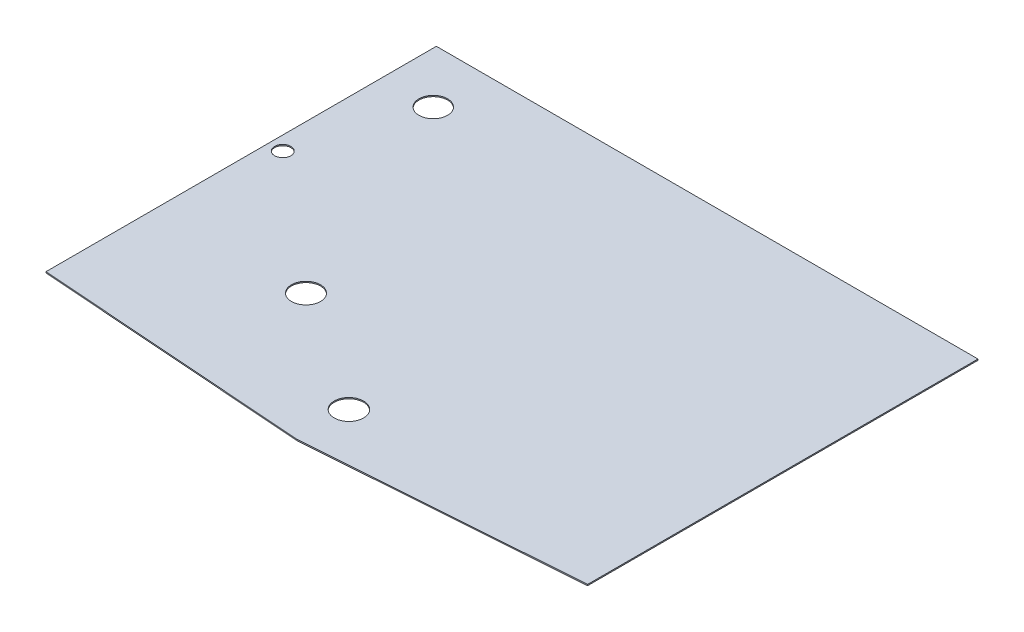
ISO-10303-21;
HEADER;
FILE_DESCRIPTION(('STEP AP214'),'2;1');
FILE_NAME('part.step','',(''),(''),'','','');
FILE_SCHEMA(('AUTOMOTIVE_DESIGN { 1 0 10303 214 1 1 1 1 }'));
ENDSEC;
DATA;
#1=APPLICATION_CONTEXT('core data for automotive mechanical design processes');
#2=APPLICATION_PROTOCOL_DEFINITION('international standard','automotive_design',2000,#1);
#3=PRODUCT_CONTEXT('',#1,'mechanical');
#4=PRODUCT('Part','Part','',(#3));
#5=PRODUCT_RELATED_PRODUCT_CATEGORY('part','',(#4));
#6=PRODUCT_DEFINITION_FORMATION('','',#4);
#7=PRODUCT_DEFINITION_CONTEXT('part definition',#1,'design');
#8=PRODUCT_DEFINITION('design','',#6,#7);
#9=PRODUCT_DEFINITION_SHAPE('','',#8);
#10=(LENGTH_UNIT() NAMED_UNIT(*) SI_UNIT(.MILLI.,.METRE.));
#11=(NAMED_UNIT(*) PLANE_ANGLE_UNIT() SI_UNIT($,.RADIAN.));
#12=(NAMED_UNIT(*) SI_UNIT($,.STERADIAN.) SOLID_ANGLE_UNIT());
#13=UNCERTAINTY_MEASURE_WITH_UNIT(LENGTH_MEASURE(1.E-05),#10,'distance_accuracy_value','');
#14=(GEOMETRIC_REPRESENTATION_CONTEXT(3) GLOBAL_UNCERTAINTY_ASSIGNED_CONTEXT((#13)) GLOBAL_UNIT_ASSIGNED_CONTEXT((#10,
#11,#12)) REPRESENTATION_CONTEXT('',''));
#15=CARTESIAN_POINT('',(0.,0.,0.));
#16=DIRECTION('',(0.,0.,1.));
#17=DIRECTION('',(1.,0.,0.));
#18=AXIS2_PLACEMENT_3D('',#15,#16,#17);
#19=CARTESIAN_POINT('',(-1111.25,-4.7625,0.));
#20=DIRECTION('',(-1.,0.,0.));
#21=DIRECTION('',(0.,0.,1.));
#22=AXIS2_PLACEMENT_3D('',#19,#20,#21);
#23=PLANE('',#22);
#24=DIRECTION('',(0.,0.,1.));
#25=VECTOR('',#24,1.);
#26=CARTESIAN_POINT('',(-1111.25,0.,0.));
#27=LINE('',#26,#25);
#28=CARTESIAN_POINT('',(-1111.25,0.,0.));
#29=VERTEX_POINT('',#28);
#30=CARTESIAN_POINT('',(-1111.25,0.,1601.7875));
#31=VERTEX_POINT('',#30);
#32=EDGE_CURVE('E116',#29,#31,#27,.T.);
#33=ORIENTED_EDGE('',*,*,#32,.F.);
#34=DIRECTION('',(0.,1.,0.));
#35=VECTOR('',#34,1.);
#36=CARTESIAN_POINT('',(-1111.25,-4.7625,0.));
#37=LINE('',#36,#35);
#38=CARTESIAN_POINT('',(-1111.25,-4.7625,0.));
#39=VERTEX_POINT('',#38);
#40=EDGE_CURVE('E11',#39,#29,#37,.T.);
#41=ORIENTED_EDGE('',*,*,#40,.F.);
#42=DIRECTION('',(0.,0.,1.));
#43=VECTOR('',#42,1.);
#44=CARTESIAN_POINT('',(-1111.25,-4.7625,0.));
#45=LINE('',#44,#43);
#46=CARTESIAN_POINT('',(-1111.25,-4.7625,1601.7875));
#47=VERTEX_POINT('',#46);
#48=EDGE_CURVE('E111',#39,#47,#45,.T.);
#49=ORIENTED_EDGE('',*,*,#48,.T.);
#50=DIRECTION('',(0.,1.,0.));
#51=VECTOR('',#50,1.);
#52=CARTESIAN_POINT('',(-1111.25,-4.7625,1601.7875));
#53=LINE('',#52,#51);
#54=EDGE_CURVE('E42',#47,#31,#53,.T.);
#55=ORIENTED_EDGE('',*,*,#54,.T.);
#56=EDGE_LOOP('',(#33,#41,#49,#55));
#57=FACE_BOUND('',#56,.T.);
#58=ADVANCED_FACE('F39',(#57),#23,.T.);
#59=CARTESIAN_POINT('',(-1111.25,-4.7625,0.));
#60=DIRECTION('',(0.,0.,-1.));
#61=DIRECTION('',(-1.,0.,0.));
#62=AXIS2_PLACEMENT_3D('',#59,#60,#61);
#63=PLANE('',#62);
#64=DIRECTION('',(-1.,0.,0.));
#65=VECTOR('',#64,1.);
#66=CARTESIAN_POINT('',(-1111.25,0.,0.));
#67=LINE('',#66,#65);
#68=CARTESIAN_POINT('',(1111.25,0.,-2.72177751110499E-13));
#69=VERTEX_POINT('',#68);
#70=EDGE_CURVE('E126',#69,#29,#67,.T.);
#71=ORIENTED_EDGE('',*,*,#70,.F.);
#72=DIRECTION('',(0.,1.,0.));
#73=VECTOR('',#72,1.);
#74=CARTESIAN_POINT('',(1111.25,-4.7625,-2.72177751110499E-13));
#75=LINE('',#74,#73);
#76=CARTESIAN_POINT('',(1111.25,-4.7625,-2.72177751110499E-13));
#77=VERTEX_POINT('',#76);
#78=EDGE_CURVE('E48',#77,#69,#75,.T.);
#79=ORIENTED_EDGE('',*,*,#78,.F.);
#80=DIRECTION('',(-1.,0.,0.));
#81=VECTOR('',#80,1.);
#82=CARTESIAN_POINT('',(-1111.25,-4.7625,0.));
#83=LINE('',#82,#81);
#84=EDGE_CURVE('E106',#77,#39,#83,.T.);
#85=ORIENTED_EDGE('',*,*,#84,.T.);
#86=ORIENTED_EDGE('',*,*,#40,.T.);
#87=EDGE_LOOP('',(#71,#79,#85,#86));
#88=FACE_BOUND('',#87,.T.);
#89=ADVANCED_FACE('F132',(#88),#63,.T.);
#90=CARTESIAN_POINT('',(1111.25,-4.7625,-2.72177751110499E-13));
#91=DIRECTION('',(1.,0.,0.));
#92=DIRECTION('',(0.,0.,-1.));
#93=AXIS2_PLACEMENT_3D('',#90,#91,#92);
#94=PLANE('',#93);
#95=DIRECTION('',(0.,0.,-1.));
#96=VECTOR('',#95,1.);
#97=CARTESIAN_POINT('',(1111.25,0.,-2.72177751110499E-13));
#98=LINE('',#97,#96);
#99=CARTESIAN_POINT('',(1111.25,0.,1601.7875));
#100=VERTEX_POINT('',#99);
#101=EDGE_CURVE('E95',#100,#69,#98,.T.);
#102=ORIENTED_EDGE('',*,*,#101,.F.);
#103=DIRECTION('',(0.,1.,0.));
#104=VECTOR('',#103,1.);
#105=CARTESIAN_POINT('',(1111.25,-4.7625,1601.7875));
#106=LINE('',#105,#104);
#107=CARTESIAN_POINT('',(1111.25,-4.7625,1601.7875));
#108=VERTEX_POINT('',#107);
#109=EDGE_CURVE('E90',#108,#100,#106,.T.);
#110=ORIENTED_EDGE('',*,*,#109,.F.);
#111=DIRECTION('',(0.,0.,-1.));
#112=VECTOR('',#111,1.);
#113=CARTESIAN_POINT('',(1111.25,-4.7625,-2.72177751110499E-13));
#114=LINE('',#113,#112);
#115=EDGE_CURVE('E93',#108,#77,#114,.T.);
#116=ORIENTED_EDGE('',*,*,#115,.T.);
#117=ORIENTED_EDGE('',*,*,#78,.T.);
#118=EDGE_LOOP('',(#102,#110,#116,#117));
#119=FACE_BOUND('',#118,.T.);
#120=ADVANCED_FACE('F92',(#119),#94,.T.);
#121=CARTESIAN_POINT('',(2.22044604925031E-13,-4.7625,1682.75));
#122=DIRECTION('',(0.0726645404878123,0.,0.997356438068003));
#123=DIRECTION('',(0.997356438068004,0.,-0.0726645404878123));
#124=AXIS2_PLACEMENT_3D('',#121,#122,#123);
#125=PLANE('',#124);
#126=DIRECTION('',(0.997356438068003,0.,-0.0726645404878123));
#127=VECTOR('',#126,1.);
#128=CARTESIAN_POINT('',(2.22044604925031E-13,0.,1682.75));
#129=LINE('',#128,#127);
#130=CARTESIAN_POINT('',(2.22044604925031E-13,0.,1682.75));
#131=VERTEX_POINT('',#130);
#132=EDGE_CURVE('E123',#131,#100,#129,.T.);
#133=ORIENTED_EDGE('',*,*,#132,.F.);
#134=DIRECTION('',(0.,1.,0.));
#135=VECTOR('',#134,1.);
#136=CARTESIAN_POINT('',(2.22044604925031E-13,-4.7625,1682.75));
#137=LINE('',#136,#135);
#138=CARTESIAN_POINT('',(2.22044604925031E-13,-4.7625,1682.75));
#139=VERTEX_POINT('',#138);
#140=EDGE_CURVE('E100',#139,#131,#137,.T.);
#141=ORIENTED_EDGE('',*,*,#140,.F.);
#142=DIRECTION('',(0.997356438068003,0.,-0.0726645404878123));
#143=VECTOR('',#142,1.);
#144=CARTESIAN_POINT('',(2.22044604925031E-13,-4.7625,1682.75));
#145=LINE('',#144,#143);
#146=EDGE_CURVE('E105',#139,#108,#145,.T.);
#147=ORIENTED_EDGE('',*,*,#146,.T.);
#148=ORIENTED_EDGE('',*,*,#109,.T.);
#149=EDGE_LOOP('',(#133,#141,#147,#148));
#150=FACE_BOUND('',#149,.T.);
#151=ADVANCED_FACE('F108',(#150),#125,.T.);
#152=CARTESIAN_POINT('',(-1111.25,-4.7625,1601.7875));
#153=DIRECTION('',(-0.0726645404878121,0.,0.997356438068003));
#154=DIRECTION('',(0.997356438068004,0.,0.0726645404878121));
#155=AXIS2_PLACEMENT_3D('',#152,#153,#154);
#156=PLANE('',#155);
#157=DIRECTION('',(0.997356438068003,0.,0.0726645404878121));
#158=VECTOR('',#157,1.);
#159=CARTESIAN_POINT('',(-1111.25,0.,1601.7875));
#160=LINE('',#159,#158);
#161=EDGE_CURVE('E119',#31,#131,#160,.T.);
#162=ORIENTED_EDGE('',*,*,#161,.F.);
#163=ORIENTED_EDGE('',*,*,#54,.F.);
#164=DIRECTION('',(0.997356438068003,0.,0.0726645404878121));
#165=VECTOR('',#164,1.);
#166=CARTESIAN_POINT('',(-1111.25,-4.7625,1601.7875));
#167=LINE('',#166,#165);
#168=EDGE_CURVE('E109',#47,#139,#167,.T.);
#169=ORIENTED_EDGE('',*,*,#168,.T.);
#170=ORIENTED_EDGE('',*,*,#140,.T.);
#171=EDGE_LOOP('',(#162,#163,#169,#170));
#172=FACE_BOUND('',#171,.T.);
#173=ADVANCED_FACE('F129',(#172),#156,.T.);
#174=CARTESIAN_POINT('',(-1111.25,-4.7625,0.));
#175=DIRECTION('',(0.,1.,0.));
#176=DIRECTION('',(0.,0.,1.));
#177=AXIS2_PLACEMENT_3D('',#174,#175,#176);
#178=PLANE('',#177);
#179=CARTESIAN_POINT('',(2.22044604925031E-13,-4.7625,1470.025));
#180=DIRECTION('',(0.,1.,0.));
#181=DIRECTION('',(0.,0.,1.));
#182=AXIS2_PLACEMENT_3D('',#179,#180,#181);
#183=CIRCLE('',#182,60.3250000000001);
#184=CARTESIAN_POINT('',(2.22044604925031E-13,-4.7625,1530.35));
#185=VERTEX_POINT('',#184);
#186=EDGE_CURVE('E175',#185,#185,#183,.T.);
#187=ORIENTED_EDGE('',*,*,#186,.T.);
#188=EDGE_LOOP('',(#187));
#189=FACE_BOUND('',#188,.T.);
#190=CARTESIAN_POINT('',(-1054.1,-4.7625,687.387499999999));
#191=DIRECTION('',(0.,1.,0.));
#192=DIRECTION('',(0.,0.,1.));
#193=AXIS2_PLACEMENT_3D('',#190,#191,#192);
#194=CIRCLE('',#193,33.3375);
#195=CARTESIAN_POINT('',(-1054.1,-4.7625,720.724999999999));
#196=VERTEX_POINT('',#195);
#197=EDGE_CURVE('E183',#196,#196,#194,.T.);
#198=ORIENTED_EDGE('',*,*,#197,.T.);
#199=EDGE_LOOP('',(#198));
#200=FACE_BOUND('',#199,.T.);
#201=CARTESIAN_POINT('',(-501.65,-4.7625,1144.5875));
#202=DIRECTION('',(0.,1.,0.));
#203=DIRECTION('',(0.,0.,1.));
#204=AXIS2_PLACEMENT_3D('',#201,#202,#203);
#205=CIRCLE('',#204,59.5312500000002);
#206=CARTESIAN_POINT('',(-501.65,-4.7625,1204.11875));
#207=VERTEX_POINT('',#206);
#208=EDGE_CURVE('E189',#207,#207,#205,.T.);
#209=ORIENTED_EDGE('',*,*,#208,.T.);
#210=EDGE_LOOP('',(#209));
#211=FACE_BOUND('',#210,.T.);
#212=CARTESIAN_POINT('',(-901.7,-4.7625,222.25));
#213=DIRECTION('',(0.,1.,0.));
#214=DIRECTION('',(0.,0.,1.));
#215=AXIS2_PLACEMENT_3D('',#212,#213,#214);
#216=CIRCLE('',#215,58.7374999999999);
#217=CARTESIAN_POINT('',(-901.7,-4.7625,280.9875));
#218=VERTEX_POINT('',#217);
#219=EDGE_CURVE('E120',#218,#218,#216,.T.);
#220=ORIENTED_EDGE('',*,*,#219,.T.);
#221=EDGE_LOOP('',(#220));
#222=FACE_BOUND('',#221,.T.);
#223=ORIENTED_EDGE('',*,*,#48,.F.);
#224=ORIENTED_EDGE('',*,*,#84,.F.);
#225=ORIENTED_EDGE('',*,*,#115,.F.);
#226=ORIENTED_EDGE('',*,*,#146,.F.);
#227=ORIENTED_EDGE('',*,*,#168,.F.);
#228=EDGE_LOOP('',(#223,#224,#225,#226,#227));
#229=FACE_BOUND('',#228,.T.);
#230=ADVANCED_FACE('F104',(#189,#200,#211,#222,#229),#178,.F.);
#231=CARTESIAN_POINT('',(-1111.25,0.,0.));
#232=DIRECTION('',(0.,1.,0.));
#233=DIRECTION('',(0.,0.,1.));
#234=AXIS2_PLACEMENT_3D('',#231,#232,#233);
#235=PLANE('',#234);
#236=CARTESIAN_POINT('',(2.22044604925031E-13,0.,1470.025));
#237=DIRECTION('',(0.,1.,0.));
#238=DIRECTION('',(0.,0.,1.));
#239=AXIS2_PLACEMENT_3D('',#236,#237,#238);
#240=CIRCLE('',#239,60.3250000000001);
#241=CARTESIAN_POINT('',(2.22044604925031E-13,0.,1530.35));
#242=VERTEX_POINT('',#241);
#243=EDGE_CURVE('E178',#242,#242,#240,.T.);
#244=ORIENTED_EDGE('',*,*,#243,.F.);
#245=EDGE_LOOP('',(#244));
#246=FACE_BOUND('',#245,.T.);
#247=CARTESIAN_POINT('',(-1054.1,0.,687.387499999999));
#248=DIRECTION('',(0.,1.,0.));
#249=DIRECTION('',(0.,0.,1.));
#250=AXIS2_PLACEMENT_3D('',#247,#248,#249);
#251=CIRCLE('',#250,33.3375);
#252=CARTESIAN_POINT('',(-1054.1,0.,720.724999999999));
#253=VERTEX_POINT('',#252);
#254=EDGE_CURVE('E180',#253,#253,#251,.T.);
#255=ORIENTED_EDGE('',*,*,#254,.F.);
#256=EDGE_LOOP('',(#255));
#257=FACE_BOUND('',#256,.T.);
#258=CARTESIAN_POINT('',(-501.65,0.,1144.5875));
#259=DIRECTION('',(0.,1.,0.));
#260=DIRECTION('',(0.,0.,1.));
#261=AXIS2_PLACEMENT_3D('',#258,#259,#260);
#262=CIRCLE('',#261,59.5312500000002);
#263=CARTESIAN_POINT('',(-501.65,0.,1204.11875));
#264=VERTEX_POINT('',#263);
#265=EDGE_CURVE('E186',#264,#264,#262,.T.);
#266=ORIENTED_EDGE('',*,*,#265,.F.);
#267=EDGE_LOOP('',(#266));
#268=FACE_BOUND('',#267,.T.);
#269=CARTESIAN_POINT('',(-901.7,0.,222.25));
#270=DIRECTION('',(0.,1.,0.));
#271=DIRECTION('',(0.,0.,1.));
#272=AXIS2_PLACEMENT_3D('',#269,#270,#271);
#273=CIRCLE('',#272,58.7374999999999);
#274=CARTESIAN_POINT('',(-901.7,0.,280.9875));
#275=VERTEX_POINT('',#274);
#276=EDGE_CURVE('E192',#275,#275,#273,.T.);
#277=ORIENTED_EDGE('',*,*,#276,.F.);
#278=EDGE_LOOP('',(#277));
#279=FACE_BOUND('',#278,.T.);
#280=ORIENTED_EDGE('',*,*,#32,.T.);
#281=ORIENTED_EDGE('',*,*,#161,.T.);
#282=ORIENTED_EDGE('',*,*,#132,.T.);
#283=ORIENTED_EDGE('',*,*,#101,.T.);
#284=ORIENTED_EDGE('',*,*,#70,.T.);
#285=EDGE_LOOP('',(#280,#281,#282,#283,#284));
#286=FACE_BOUND('',#285,.T.);
#287=ADVANCED_FACE('F131',(#246,#257,#268,#279,#286),#235,.T.);
#288=CARTESIAN_POINT('',(-901.7,-4.7625,222.25));
#289=DIRECTION('',(0.,1.,0.));
#290=DIRECTION('',(0.,0.,1.));
#291=AXIS2_PLACEMENT_3D('',#288,#289,#290);
#292=CYLINDRICAL_SURFACE('',#291,58.7374999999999);
#293=CARTESIAN_POINT('',(-901.7,-4.7625,280.9875));
#294=CARTESIAN_POINT('',(-901.7,-4.712890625,280.9875));
#295=CARTESIAN_POINT('',(-901.7,-4.66328125,280.9875));
#296=CARTESIAN_POINT('',(-901.7,-4.5640625,280.9875));
#297=CARTESIAN_POINT('',(-901.7,-4.514453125,280.9875));
#298=CARTESIAN_POINT('',(-901.7,-4.415234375,280.9875));
#299=CARTESIAN_POINT('',(-901.7,-4.365625,280.9875));
#300=CARTESIAN_POINT('',(-901.7,-4.26640625,280.9875));
#301=CARTESIAN_POINT('',(-901.7,-4.216796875,280.9875));
#302=CARTESIAN_POINT('',(-901.7,-4.117578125,280.9875));
#303=CARTESIAN_POINT('',(-901.7,-4.06796875,280.9875));
#304=CARTESIAN_POINT('',(-901.7,-3.96875,280.9875));
#305=CARTESIAN_POINT('',(-901.7,-3.919140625,280.9875));
#306=CARTESIAN_POINT('',(-901.7,-3.819921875,280.9875));
#307=CARTESIAN_POINT('',(-901.7,-3.7703125,280.9875));
#308=CARTESIAN_POINT('',(-901.7,-3.67109375,280.9875));
#309=CARTESIAN_POINT('',(-901.7,-3.621484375,280.9875));
#310=CARTESIAN_POINT('',(-901.7,-3.522265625,280.9875));
#311=CARTESIAN_POINT('',(-901.7,-3.47265625,280.9875));
#312=CARTESIAN_POINT('',(-901.7,-3.3734375,280.9875));
#313=CARTESIAN_POINT('',(-901.7,-3.323828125,280.9875));
#314=CARTESIAN_POINT('',(-901.7,-3.224609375,280.9875));
#315=CARTESIAN_POINT('',(-901.7,-3.175,280.9875));
#316=CARTESIAN_POINT('',(-901.7,-3.07578125,280.9875));
#317=CARTESIAN_POINT('',(-901.7,-3.026171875,280.9875));
#318=CARTESIAN_POINT('',(-901.7,-2.926953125,280.9875));
#319=CARTESIAN_POINT('',(-901.7,-2.87734375,280.9875));
#320=CARTESIAN_POINT('',(-901.7,-2.778125,280.9875));
#321=CARTESIAN_POINT('',(-901.7,-2.728515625,280.9875));
#322=CARTESIAN_POINT('',(-901.7,-2.629296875,280.9875));
#323=CARTESIAN_POINT('',(-901.7,-2.5796875,280.9875));
#324=CARTESIAN_POINT('',(-901.7,-2.48046875,280.9875));
#325=CARTESIAN_POINT('',(-901.7,-2.430859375,280.9875));
#326=CARTESIAN_POINT('',(-901.7,-2.331640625,280.9875));
#327=CARTESIAN_POINT('',(-901.7,-2.28203125,280.9875));
#328=CARTESIAN_POINT('',(-901.7,-2.1828125,280.9875));
#329=CARTESIAN_POINT('',(-901.7,-2.133203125,280.9875));
#330=CARTESIAN_POINT('',(-901.7,-2.033984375,280.9875));
#331=CARTESIAN_POINT('',(-901.7,-1.984375,280.9875));
#332=CARTESIAN_POINT('',(-901.7,-1.88515625,280.9875));
#333=CARTESIAN_POINT('',(-901.7,-1.835546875,280.9875));
#334=CARTESIAN_POINT('',(-901.7,-1.736328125,280.9875));
#335=CARTESIAN_POINT('',(-901.7,-1.68671875,280.9875));
#336=CARTESIAN_POINT('',(-901.7,-1.5875,280.9875));
#337=CARTESIAN_POINT('',(-901.7,-1.537890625,280.9875));
#338=CARTESIAN_POINT('',(-901.7,-1.438671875,280.9875));
#339=CARTESIAN_POINT('',(-901.7,-1.3890625,280.9875));
#340=CARTESIAN_POINT('',(-901.7,-1.28984375,280.9875));
#341=CARTESIAN_POINT('',(-901.7,-1.240234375,280.9875));
#342=CARTESIAN_POINT('',(-901.7,-1.141015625,280.9875));
#343=CARTESIAN_POINT('',(-901.7,-1.09140625,280.9875));
#344=CARTESIAN_POINT('',(-901.7,-0.9921875,280.9875));
#345=CARTESIAN_POINT('',(-901.7,-0.942578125,280.9875));
#346=CARTESIAN_POINT('',(-901.7,-0.843359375,280.9875));
#347=CARTESIAN_POINT('',(-901.7,-0.79375,280.9875));
#348=CARTESIAN_POINT('',(-901.7,-0.69453125,280.9875));
#349=CARTESIAN_POINT('',(-901.7,-0.644921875,280.9875));
#350=CARTESIAN_POINT('',(-901.7,-0.545703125,280.9875));
#351=CARTESIAN_POINT('',(-901.7,-0.49609375,280.9875));
#352=CARTESIAN_POINT('',(-901.7,-0.396875,280.9875));
#353=CARTESIAN_POINT('',(-901.7,-0.347265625,280.9875));
#354=CARTESIAN_POINT('',(-901.7,-0.248046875,280.9875));
#355=CARTESIAN_POINT('',(-901.7,-0.1984375,280.9875));
#356=CARTESIAN_POINT('',(-901.7,-0.09921875,280.9875));
#357=CARTESIAN_POINT('',(-901.7,-0.049609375,280.9875));
#358=CARTESIAN_POINT('',(-901.7,0.,280.9875));
#359=B_SPLINE_CURVE_WITH_KNOTS('',3,(#293,#294,#295,#296,#297,#298,#299,#300,#301,#302,#303,
#304,#305,#306,#307,#308,#309,#310,#311,#312,#313,#314,#315,#316,#317,#318,#319,#320,#321,#322,
#323,#324,#325,#326,#327,#328,#329,#330,#331,#332,#333,#334,#335,#336,#337,#338,#339,#340,#341,
#342,#343,#344,#345,#346,#347,#348,#349,#350,#351,#352,#353,#354,#355,#356,#357,#358),
.UNSPECIFIED.,.F.,.F.,(4,2,2,2,2,2,2,2,2,2,2,2,2,2,2,2,2,2,2,2,2,2,2,2,2,2,2,2,2,2,2,2,4),(0.,
0.148828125,0.29765625,0.446484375,0.5953125,0.744140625,0.892968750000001,1.041796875,1.190625,
1.339453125,1.48828125,1.637109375,1.7859375,1.934765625,2.08359375,2.232421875,2.38125,
2.530078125,2.67890625,2.827734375,2.9765625,3.125390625,3.27421875,3.423046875,3.571875,
3.720703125,3.86953125,4.018359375,4.1671875,4.316015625,4.46484375,4.613671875,4.7625),.UNSPECIFIED.);
#360=EDGE_CURVE('BSEAM152',#218,#275,#359,.T.);
#361=ORIENTED_EDGE('',*,*,#219,.F.);
#362=ORIENTED_EDGE('',*,*,#276,.T.);
#363=ORIENTED_EDGE('',*,*,#360,.T.);
#364=ORIENTED_EDGE('',*,*,#360,.F.);
#365=EDGE_LOOP('',(#361,#363,#362,#364));
#366=FACE_BOUND('',#365,.T.);
#367=ADVANCED_FACE('F152',(#366),#292,.F.);
#368=CARTESIAN_POINT('',(-501.65,-4.7625,1144.5875));
#369=DIRECTION('',(0.,1.,0.));
#370=DIRECTION('',(0.,0.,1.));
#371=AXIS2_PLACEMENT_3D('',#368,#369,#370);
#372=CYLINDRICAL_SURFACE('',#371,59.5312500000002);
#373=CARTESIAN_POINT('',(-501.65,-4.7625,1204.11875));
#374=CARTESIAN_POINT('',(-501.65,-4.712890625,1204.11875));
#375=CARTESIAN_POINT('',(-501.65,-4.66328125,1204.11875));
#376=CARTESIAN_POINT('',(-501.65,-4.5640625,1204.11875));
#377=CARTESIAN_POINT('',(-501.65,-4.514453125,1204.11875));
#378=CARTESIAN_POINT('',(-501.65,-4.415234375,1204.11875));
#379=CARTESIAN_POINT('',(-501.65,-4.365625,1204.11875));
#380=CARTESIAN_POINT('',(-501.65,-4.26640625,1204.11875));
#381=CARTESIAN_POINT('',(-501.65,-4.216796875,1204.11875));
#382=CARTESIAN_POINT('',(-501.65,-4.117578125,1204.11875));
#383=CARTESIAN_POINT('',(-501.65,-4.06796875,1204.11875));
#384=CARTESIAN_POINT('',(-501.65,-3.96875,1204.11875));
#385=CARTESIAN_POINT('',(-501.65,-3.919140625,1204.11875));
#386=CARTESIAN_POINT('',(-501.65,-3.819921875,1204.11875));
#387=CARTESIAN_POINT('',(-501.65,-3.7703125,1204.11875));
#388=CARTESIAN_POINT('',(-501.65,-3.67109375,1204.11875));
#389=CARTESIAN_POINT('',(-501.65,-3.621484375,1204.11875));
#390=CARTESIAN_POINT('',(-501.65,-3.522265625,1204.11875));
#391=CARTESIAN_POINT('',(-501.65,-3.47265625,1204.11875));
#392=CARTESIAN_POINT('',(-501.65,-3.3734375,1204.11875));
#393=CARTESIAN_POINT('',(-501.65,-3.323828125,1204.11875));
#394=CARTESIAN_POINT('',(-501.65,-3.224609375,1204.11875));
#395=CARTESIAN_POINT('',(-501.65,-3.175,1204.11875));
#396=CARTESIAN_POINT('',(-501.65,-3.07578125,1204.11875));
#397=CARTESIAN_POINT('',(-501.65,-3.026171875,1204.11875));
#398=CARTESIAN_POINT('',(-501.65,-2.926953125,1204.11875));
#399=CARTESIAN_POINT('',(-501.65,-2.87734375,1204.11875));
#400=CARTESIAN_POINT('',(-501.65,-2.778125,1204.11875));
#401=CARTESIAN_POINT('',(-501.65,-2.728515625,1204.11875));
#402=CARTESIAN_POINT('',(-501.65,-2.629296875,1204.11875));
#403=CARTESIAN_POINT('',(-501.65,-2.5796875,1204.11875));
#404=CARTESIAN_POINT('',(-501.65,-2.48046875,1204.11875));
#405=CARTESIAN_POINT('',(-501.65,-2.430859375,1204.11875));
#406=CARTESIAN_POINT('',(-501.65,-2.331640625,1204.11875));
#407=CARTESIAN_POINT('',(-501.65,-2.28203125,1204.11875));
#408=CARTESIAN_POINT('',(-501.65,-2.1828125,1204.11875));
#409=CARTESIAN_POINT('',(-501.65,-2.133203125,1204.11875));
#410=CARTESIAN_POINT('',(-501.65,-2.033984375,1204.11875));
#411=CARTESIAN_POINT('',(-501.65,-1.984375,1204.11875));
#412=CARTESIAN_POINT('',(-501.65,-1.88515625,1204.11875));
#413=CARTESIAN_POINT('',(-501.65,-1.835546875,1204.11875));
#414=CARTESIAN_POINT('',(-501.65,-1.736328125,1204.11875));
#415=CARTESIAN_POINT('',(-501.65,-1.68671875,1204.11875));
#416=CARTESIAN_POINT('',(-501.65,-1.5875,1204.11875));
#417=CARTESIAN_POINT('',(-501.65,-1.537890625,1204.11875));
#418=CARTESIAN_POINT('',(-501.65,-1.438671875,1204.11875));
#419=CARTESIAN_POINT('',(-501.65,-1.3890625,1204.11875));
#420=CARTESIAN_POINT('',(-501.65,-1.28984375,1204.11875));
#421=CARTESIAN_POINT('',(-501.65,-1.240234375,1204.11875));
#422=CARTESIAN_POINT('',(-501.65,-1.141015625,1204.11875));
#423=CARTESIAN_POINT('',(-501.65,-1.09140625,1204.11875));
#424=CARTESIAN_POINT('',(-501.65,-0.9921875,1204.11875));
#425=CARTESIAN_POINT('',(-501.65,-0.942578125,1204.11875));
#426=CARTESIAN_POINT('',(-501.65,-0.843359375,1204.11875));
#427=CARTESIAN_POINT('',(-501.65,-0.79375,1204.11875));
#428=CARTESIAN_POINT('',(-501.65,-0.69453125,1204.11875));
#429=CARTESIAN_POINT('',(-501.65,-0.644921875,1204.11875));
#430=CARTESIAN_POINT('',(-501.65,-0.545703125,1204.11875));
#431=CARTESIAN_POINT('',(-501.65,-0.49609375,1204.11875));
#432=CARTESIAN_POINT('',(-501.65,-0.396875,1204.11875));
#433=CARTESIAN_POINT('',(-501.65,-0.347265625,1204.11875));
#434=CARTESIAN_POINT('',(-501.65,-0.248046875,1204.11875));
#435=CARTESIAN_POINT('',(-501.65,-0.1984375,1204.11875));
#436=CARTESIAN_POINT('',(-501.65,-0.09921875,1204.11875));
#437=CARTESIAN_POINT('',(-501.65,-0.049609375,1204.11875));
#438=CARTESIAN_POINT('',(-501.65,0.,1204.11875));
#439=B_SPLINE_CURVE_WITH_KNOTS('',3,(#373,#374,#375,#376,#377,#378,#379,#380,#381,#382,#383,
#384,#385,#386,#387,#388,#389,#390,#391,#392,#393,#394,#395,#396,#397,#398,#399,#400,#401,#402,
#403,#404,#405,#406,#407,#408,#409,#410,#411,#412,#413,#414,#415,#416,#417,#418,#419,#420,#421,
#422,#423,#424,#425,#426,#427,#428,#429,#430,#431,#432,#433,#434,#435,#436,#437,#438),
.UNSPECIFIED.,.F.,.F.,(4,2,2,2,2,2,2,2,2,2,2,2,2,2,2,2,2,2,2,2,2,2,2,2,2,2,2,2,2,2,2,2,4),(0.,
0.148828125,0.29765625,0.446484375,0.5953125,0.744140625,0.892968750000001,1.041796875,1.190625,
1.339453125,1.48828125,1.637109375,1.7859375,1.934765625,2.08359375,2.232421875,2.38125,
2.530078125,2.67890625,2.827734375,2.9765625,3.125390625,3.27421875,3.423046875,3.571875,
3.720703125,3.86953125,4.018359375,4.1671875,4.316015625,4.46484375,4.613671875,4.7625),.UNSPECIFIED.);
#440=EDGE_CURVE('BSEAM159',#207,#264,#439,.T.);
#441=ORIENTED_EDGE('',*,*,#208,.F.);
#442=ORIENTED_EDGE('',*,*,#265,.T.);
#443=ORIENTED_EDGE('',*,*,#440,.T.);
#444=ORIENTED_EDGE('',*,*,#440,.F.);
#445=EDGE_LOOP('',(#441,#443,#442,#444));
#446=FACE_BOUND('',#445,.T.);
#447=ADVANCED_FACE('F159',(#446),#372,.F.);
#448=CARTESIAN_POINT('',(-1054.1,-4.7625,687.387499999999));
#449=DIRECTION('',(0.,1.,0.));
#450=DIRECTION('',(0.,0.,1.));
#451=AXIS2_PLACEMENT_3D('',#448,#449,#450);
#452=CYLINDRICAL_SURFACE('',#451,33.3375);
#453=CARTESIAN_POINT('',(-1054.1,-4.7625,720.724999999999));
#454=CARTESIAN_POINT('',(-1054.1,-4.712890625,720.724999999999));
#455=CARTESIAN_POINT('',(-1054.1,-4.66328125,720.724999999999));
#456=CARTESIAN_POINT('',(-1054.1,-4.5640625,720.724999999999));
#457=CARTESIAN_POINT('',(-1054.1,-4.514453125,720.724999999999));
#458=CARTESIAN_POINT('',(-1054.1,-4.415234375,720.724999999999));
#459=CARTESIAN_POINT('',(-1054.1,-4.365625,720.724999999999));
#460=CARTESIAN_POINT('',(-1054.1,-4.26640625,720.724999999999));
#461=CARTESIAN_POINT('',(-1054.1,-4.216796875,720.724999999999));
#462=CARTESIAN_POINT('',(-1054.1,-4.117578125,720.724999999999));
#463=CARTESIAN_POINT('',(-1054.1,-4.06796875,720.724999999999));
#464=CARTESIAN_POINT('',(-1054.1,-3.96875,720.724999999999));
#465=CARTESIAN_POINT('',(-1054.1,-3.919140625,720.724999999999));
#466=CARTESIAN_POINT('',(-1054.1,-3.819921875,720.724999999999));
#467=CARTESIAN_POINT('',(-1054.1,-3.7703125,720.724999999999));
#468=CARTESIAN_POINT('',(-1054.1,-3.67109375,720.724999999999));
#469=CARTESIAN_POINT('',(-1054.1,-3.621484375,720.724999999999));
#470=CARTESIAN_POINT('',(-1054.1,-3.522265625,720.724999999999));
#471=CARTESIAN_POINT('',(-1054.1,-3.47265625,720.724999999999));
#472=CARTESIAN_POINT('',(-1054.1,-3.3734375,720.724999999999));
#473=CARTESIAN_POINT('',(-1054.1,-3.323828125,720.724999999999));
#474=CARTESIAN_POINT('',(-1054.1,-3.224609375,720.724999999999));
#475=CARTESIAN_POINT('',(-1054.1,-3.175,720.724999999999));
#476=CARTESIAN_POINT('',(-1054.1,-3.07578125,720.724999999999));
#477=CARTESIAN_POINT('',(-1054.1,-3.026171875,720.724999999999));
#478=CARTESIAN_POINT('',(-1054.1,-2.926953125,720.724999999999));
#479=CARTESIAN_POINT('',(-1054.1,-2.87734375,720.724999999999));
#480=CARTESIAN_POINT('',(-1054.1,-2.778125,720.724999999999));
#481=CARTESIAN_POINT('',(-1054.1,-2.728515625,720.724999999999));
#482=CARTESIAN_POINT('',(-1054.1,-2.629296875,720.724999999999));
#483=CARTESIAN_POINT('',(-1054.1,-2.5796875,720.724999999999));
#484=CARTESIAN_POINT('',(-1054.1,-2.48046875,720.724999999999));
#485=CARTESIAN_POINT('',(-1054.1,-2.430859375,720.724999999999));
#486=CARTESIAN_POINT('',(-1054.1,-2.331640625,720.724999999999));
#487=CARTESIAN_POINT('',(-1054.1,-2.28203125,720.724999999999));
#488=CARTESIAN_POINT('',(-1054.1,-2.1828125,720.724999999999));
#489=CARTESIAN_POINT('',(-1054.1,-2.133203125,720.724999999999));
#490=CARTESIAN_POINT('',(-1054.1,-2.033984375,720.724999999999));
#491=CARTESIAN_POINT('',(-1054.1,-1.984375,720.724999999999));
#492=CARTESIAN_POINT('',(-1054.1,-1.88515625,720.724999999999));
#493=CARTESIAN_POINT('',(-1054.1,-1.835546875,720.724999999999));
#494=CARTESIAN_POINT('',(-1054.1,-1.736328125,720.724999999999));
#495=CARTESIAN_POINT('',(-1054.1,-1.68671875,720.724999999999));
#496=CARTESIAN_POINT('',(-1054.1,-1.5875,720.724999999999));
#497=CARTESIAN_POINT('',(-1054.1,-1.537890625,720.724999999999));
#498=CARTESIAN_POINT('',(-1054.1,-1.438671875,720.724999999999));
#499=CARTESIAN_POINT('',(-1054.1,-1.3890625,720.724999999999));
#500=CARTESIAN_POINT('',(-1054.1,-1.28984375,720.724999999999));
#501=CARTESIAN_POINT('',(-1054.1,-1.240234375,720.724999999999));
#502=CARTESIAN_POINT('',(-1054.1,-1.141015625,720.724999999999));
#503=CARTESIAN_POINT('',(-1054.1,-1.09140625,720.724999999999));
#504=CARTESIAN_POINT('',(-1054.1,-0.9921875,720.724999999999));
#505=CARTESIAN_POINT('',(-1054.1,-0.942578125,720.724999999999));
#506=CARTESIAN_POINT('',(-1054.1,-0.843359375,720.724999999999));
#507=CARTESIAN_POINT('',(-1054.1,-0.79375,720.724999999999));
#508=CARTESIAN_POINT('',(-1054.1,-0.69453125,720.724999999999));
#509=CARTESIAN_POINT('',(-1054.1,-0.644921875,720.724999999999));
#510=CARTESIAN_POINT('',(-1054.1,-0.545703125,720.724999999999));
#511=CARTESIAN_POINT('',(-1054.1,-0.49609375,720.724999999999));
#512=CARTESIAN_POINT('',(-1054.1,-0.396875,720.724999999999));
#513=CARTESIAN_POINT('',(-1054.1,-0.347265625,720.724999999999));
#514=CARTESIAN_POINT('',(-1054.1,-0.248046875,720.724999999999));
#515=CARTESIAN_POINT('',(-1054.1,-0.1984375,720.724999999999));
#516=CARTESIAN_POINT('',(-1054.1,-0.09921875,720.724999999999));
#517=CARTESIAN_POINT('',(-1054.1,-0.049609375,720.724999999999));
#518=CARTESIAN_POINT('',(-1054.1,0.,720.724999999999));
#519=B_SPLINE_CURVE_WITH_KNOTS('',3,(#453,#454,#455,#456,#457,#458,#459,#460,#461,#462,#463,
#464,#465,#466,#467,#468,#469,#470,#471,#472,#473,#474,#475,#476,#477,#478,#479,#480,#481,#482,
#483,#484,#485,#486,#487,#488,#489,#490,#491,#492,#493,#494,#495,#496,#497,#498,#499,#500,#501,
#502,#503,#504,#505,#506,#507,#508,#509,#510,#511,#512,#513,#514,#515,#516,#517,#518),
.UNSPECIFIED.,.F.,.F.,(4,2,2,2,2,2,2,2,2,2,2,2,2,2,2,2,2,2,2,2,2,2,2,2,2,2,2,2,2,2,2,2,4),(0.,
0.148828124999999,0.297656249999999,0.446484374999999,0.595312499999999,0.744140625,0.89296875,
1.041796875,1.190625,1.339453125,1.48828125,1.637109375,1.7859375,1.934765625,2.08359375,
2.232421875,2.38125,2.530078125,2.67890625,2.827734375,2.9765625,3.125390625,3.27421875,
3.423046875,3.571875,3.720703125,3.86953125,4.018359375,4.1671875,4.316015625,4.46484375,
4.613671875,4.7625),.UNSPECIFIED.);
#520=EDGE_CURVE('BSEAM163',#196,#253,#519,.T.);
#521=ORIENTED_EDGE('',*,*,#197,.F.);
#522=ORIENTED_EDGE('',*,*,#254,.T.);
#523=ORIENTED_EDGE('',*,*,#520,.T.);
#524=ORIENTED_EDGE('',*,*,#520,.F.);
#525=EDGE_LOOP('',(#521,#523,#522,#524));
#526=FACE_BOUND('',#525,.T.);
#527=ADVANCED_FACE('F163',(#526),#452,.F.);
#528=CARTESIAN_POINT('',(2.22044604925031E-13,-4.7625,1470.025));
#529=DIRECTION('',(0.,1.,0.));
#530=DIRECTION('',(0.,0.,1.));
#531=AXIS2_PLACEMENT_3D('',#528,#529,#530);
#532=CYLINDRICAL_SURFACE('',#531,60.3250000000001);
#533=CARTESIAN_POINT('',(2.22044604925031E-13,-4.7625,1530.35));
#534=CARTESIAN_POINT('',(2.22044604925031E-13,-4.712890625,1530.35));
#535=CARTESIAN_POINT('',(2.22044604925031E-13,-4.66328125,1530.35));
#536=CARTESIAN_POINT('',(2.22044604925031E-13,-4.5640625,1530.35));
#537=CARTESIAN_POINT('',(2.22044604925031E-13,-4.514453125,1530.35));
#538=CARTESIAN_POINT('',(2.22044604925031E-13,-4.415234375,1530.35));
#539=CARTESIAN_POINT('',(2.22044604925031E-13,-4.365625,1530.35));
#540=CARTESIAN_POINT('',(2.22044604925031E-13,-4.26640625,1530.35));
#541=CARTESIAN_POINT('',(2.22044604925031E-13,-4.216796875,1530.35));
#542=CARTESIAN_POINT('',(2.22044604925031E-13,-4.117578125,1530.35));
#543=CARTESIAN_POINT('',(2.22044604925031E-13,-4.06796875,1530.35));
#544=CARTESIAN_POINT('',(2.22044604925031E-13,-3.96875,1530.35));
#545=CARTESIAN_POINT('',(2.22044604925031E-13,-3.919140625,1530.35));
#546=CARTESIAN_POINT('',(2.22044604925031E-13,-3.819921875,1530.35));
#547=CARTESIAN_POINT('',(2.22044604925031E-13,-3.7703125,1530.35));
#548=CARTESIAN_POINT('',(2.22044604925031E-13,-3.67109375,1530.35));
#549=CARTESIAN_POINT('',(2.22044604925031E-13,-3.621484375,1530.35));
#550=CARTESIAN_POINT('',(2.22044604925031E-13,-3.522265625,1530.35));
#551=CARTESIAN_POINT('',(2.22044604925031E-13,-3.47265625,1530.35));
#552=CARTESIAN_POINT('',(2.22044604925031E-13,-3.3734375,1530.35));
#553=CARTESIAN_POINT('',(2.22044604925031E-13,-3.323828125,1530.35));
#554=CARTESIAN_POINT('',(2.22044604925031E-13,-3.224609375,1530.35));
#555=CARTESIAN_POINT('',(2.22044604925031E-13,-3.175,1530.35));
#556=CARTESIAN_POINT('',(2.22044604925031E-13,-3.07578125,1530.35));
#557=CARTESIAN_POINT('',(2.22044604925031E-13,-3.026171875,1530.35));
#558=CARTESIAN_POINT('',(2.22044604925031E-13,-2.926953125,1530.35));
#559=CARTESIAN_POINT('',(2.22044604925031E-13,-2.87734375,1530.35));
#560=CARTESIAN_POINT('',(2.22044604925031E-13,-2.778125,1530.35));
#561=CARTESIAN_POINT('',(2.22044604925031E-13,-2.728515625,1530.35));
#562=CARTESIAN_POINT('',(2.22044604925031E-13,-2.629296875,1530.35));
#563=CARTESIAN_POINT('',(2.22044604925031E-13,-2.5796875,1530.35));
#564=CARTESIAN_POINT('',(2.22044604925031E-13,-2.48046875,1530.35));
#565=CARTESIAN_POINT('',(2.22044604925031E-13,-2.430859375,1530.35));
#566=CARTESIAN_POINT('',(2.22044604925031E-13,-2.331640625,1530.35));
#567=CARTESIAN_POINT('',(2.22044604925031E-13,-2.28203125,1530.35));
#568=CARTESIAN_POINT('',(2.22044604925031E-13,-2.1828125,1530.35));
#569=CARTESIAN_POINT('',(2.22044604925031E-13,-2.133203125,1530.35));
#570=CARTESIAN_POINT('',(2.22044604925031E-13,-2.033984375,1530.35));
#571=CARTESIAN_POINT('',(2.22044604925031E-13,-1.984375,1530.35));
#572=CARTESIAN_POINT('',(2.22044604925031E-13,-1.88515625,1530.35));
#573=CARTESIAN_POINT('',(2.22044604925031E-13,-1.835546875,1530.35));
#574=CARTESIAN_POINT('',(2.22044604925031E-13,-1.736328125,1530.35));
#575=CARTESIAN_POINT('',(2.22044604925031E-13,-1.68671875,1530.35));
#576=CARTESIAN_POINT('',(2.22044604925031E-13,-1.5875,1530.35));
#577=CARTESIAN_POINT('',(2.22044604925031E-13,-1.537890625,1530.35));
#578=CARTESIAN_POINT('',(2.22044604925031E-13,-1.438671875,1530.35));
#579=CARTESIAN_POINT('',(2.22044604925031E-13,-1.3890625,1530.35));
#580=CARTESIAN_POINT('',(2.22044604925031E-13,-1.28984375,1530.35));
#581=CARTESIAN_POINT('',(2.22044604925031E-13,-1.240234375,1530.35));
#582=CARTESIAN_POINT('',(2.22044604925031E-13,-1.141015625,1530.35));
#583=CARTESIAN_POINT('',(2.22044604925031E-13,-1.09140625,1530.35));
#584=CARTESIAN_POINT('',(2.22044604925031E-13,-0.9921875,1530.35));
#585=CARTESIAN_POINT('',(2.22044604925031E-13,-0.942578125,1530.35));
#586=CARTESIAN_POINT('',(2.22044604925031E-13,-0.843359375,1530.35));
#587=CARTESIAN_POINT('',(2.22044604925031E-13,-0.79375,1530.35));
#588=CARTESIAN_POINT('',(2.22044604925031E-13,-0.69453125,1530.35));
#589=CARTESIAN_POINT('',(2.22044604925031E-13,-0.644921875,1530.35));
#590=CARTESIAN_POINT('',(2.22044604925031E-13,-0.545703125,1530.35));
#591=CARTESIAN_POINT('',(2.22044604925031E-13,-0.49609375,1530.35));
#592=CARTESIAN_POINT('',(2.22044604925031E-13,-0.396875,1530.35));
#593=CARTESIAN_POINT('',(2.22044604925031E-13,-0.347265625,1530.35));
#594=CARTESIAN_POINT('',(2.22044604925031E-13,-0.248046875,1530.35));
#595=CARTESIAN_POINT('',(2.22044604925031E-13,-0.1984375,1530.35));
#596=CARTESIAN_POINT('',(2.22044604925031E-13,-0.09921875,1530.35));
#597=CARTESIAN_POINT('',(2.22044604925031E-13,-0.049609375,1530.35));
#598=CARTESIAN_POINT('',(2.22044604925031E-13,0.,1530.35));
#599=B_SPLINE_CURVE_WITH_KNOTS('',3,(#533,#534,#535,#536,#537,#538,#539,#540,#541,#542,#543,
#544,#545,#546,#547,#548,#549,#550,#551,#552,#553,#554,#555,#556,#557,#558,#559,#560,#561,#562,
#563,#564,#565,#566,#567,#568,#569,#570,#571,#572,#573,#574,#575,#576,#577,#578,#579,#580,#581,
#582,#583,#584,#585,#586,#587,#588,#589,#590,#591,#592,#593,#594,#595,#596,#597,#598),
.UNSPECIFIED.,.F.,.F.,(4,2,2,2,2,2,2,2,2,2,2,2,2,2,2,2,2,2,2,2,2,2,2,2,2,2,2,2,2,2,2,2,4),(0.,
0.148828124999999,0.297656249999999,0.446484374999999,0.595312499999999,0.744140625,0.89296875,
1.041796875,1.190625,1.339453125,1.48828125,1.637109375,1.7859375,1.934765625,2.08359375,
2.232421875,2.38125,2.530078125,2.67890625,2.827734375,2.9765625,3.125390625,3.27421875,
3.423046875,3.571875,3.720703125,3.86953125,4.018359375,4.1671875,4.316015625,4.46484375,
4.613671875,4.7625),.UNSPECIFIED.);
#600=EDGE_CURVE('BSEAM167',#185,#242,#599,.T.);
#601=ORIENTED_EDGE('',*,*,#186,.F.);
#602=ORIENTED_EDGE('',*,*,#243,.T.);
#603=ORIENTED_EDGE('',*,*,#600,.T.);
#604=ORIENTED_EDGE('',*,*,#600,.F.);
#605=EDGE_LOOP('',(#601,#603,#602,#604));
#606=FACE_BOUND('',#605,.T.);
#607=ADVANCED_FACE('F167',(#606),#532,.F.);
#608=CLOSED_SHELL('',(#58,#89,#120,#151,#173,#230,#287,#367,#447,#527,#607));
#609=MANIFOLD_SOLID_BREP('B2',#608);
#610=ADVANCED_BREP_SHAPE_REPRESENTATION('',(#18,#609),#14);
#611=SHAPE_DEFINITION_REPRESENTATION(#9,#610);
ENDSEC;
END-ISO-10303-21;
